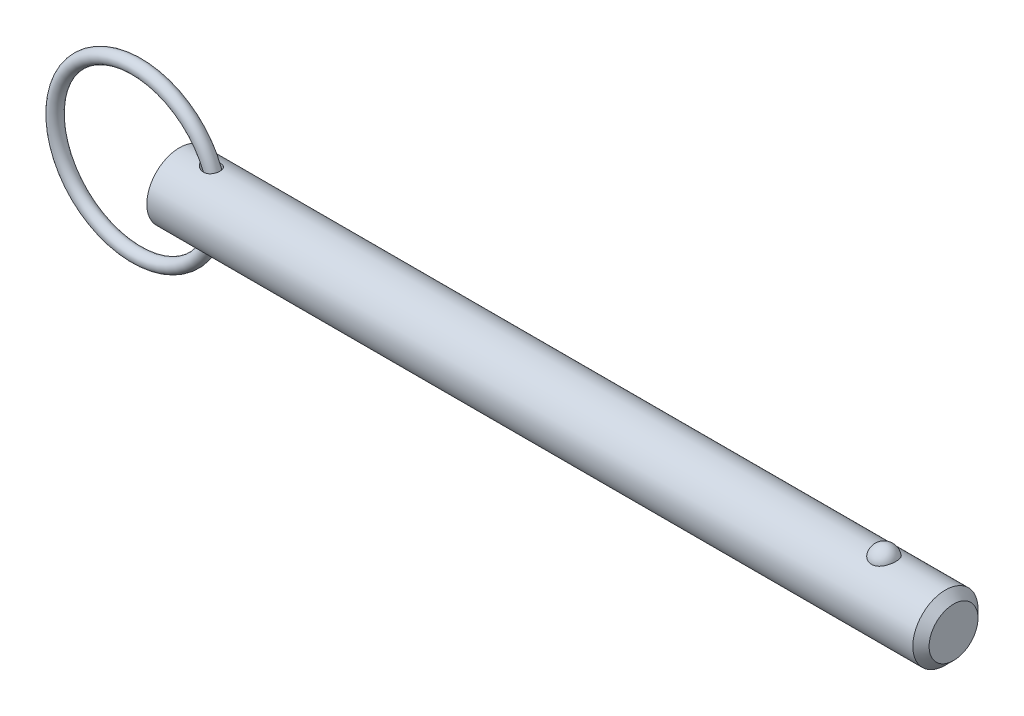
ISO-10303-21;
HEADER;
FILE_DESCRIPTION(('STEP AP214'),'2;1');
FILE_NAME('part.step','',(''),(''),'','','');
FILE_SCHEMA(('AUTOMOTIVE_DESIGN { 1 0 10303 214 1 1 1 1 }'));
ENDSEC;
DATA;
#1=APPLICATION_CONTEXT('core data for automotive mechanical design processes');
#2=APPLICATION_PROTOCOL_DEFINITION('international standard','automotive_design',2000,#1);
#3=PRODUCT_CONTEXT('',#1,'mechanical');
#4=PRODUCT('Part','Part','',(#3));
#5=PRODUCT_RELATED_PRODUCT_CATEGORY('part','',(#4));
#6=PRODUCT_DEFINITION_FORMATION('','',#4);
#7=PRODUCT_DEFINITION_CONTEXT('part definition',#1,'design');
#8=PRODUCT_DEFINITION('design','',#6,#7);
#9=PRODUCT_DEFINITION_SHAPE('','',#8);
#10=(LENGTH_UNIT() NAMED_UNIT(*) SI_UNIT(.MILLI.,.METRE.));
#11=(NAMED_UNIT(*) PLANE_ANGLE_UNIT() SI_UNIT($,.RADIAN.));
#12=(NAMED_UNIT(*) SI_UNIT($,.STERADIAN.) SOLID_ANGLE_UNIT());
#13=UNCERTAINTY_MEASURE_WITH_UNIT(LENGTH_MEASURE(1.E-05),#10,'distance_accuracy_value','');
#14=(GEOMETRIC_REPRESENTATION_CONTEXT(3) GLOBAL_UNCERTAINTY_ASSIGNED_CONTEXT((#13)) GLOBAL_UNIT_ASSIGNED_CONTEXT((#10,
#11,#12)) REPRESENTATION_CONTEXT('',''));
#15=CARTESIAN_POINT('',(0.,0.,0.));
#16=DIRECTION('',(0.,0.,1.));
#17=DIRECTION('',(1.,0.,0.));
#18=AXIS2_PLACEMENT_3D('',#15,#16,#17);
#19=CARTESIAN_POINT('',(-8.34703434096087,0.,0.));
#20=DIRECTION('',(0.,0.,1.));
#21=DIRECTION('',(1.,0.,0.));
#22=AXIS2_PLACEMENT_3D('',#19,#20,#21);
#23=TOROIDAL_SURFACE('',#22,15.875,1.27);
#24=CARTESIAN_POINT('',(8.79796565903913,0.,0.));
#25=VERTEX_POINT('',#24);
#26=VERTEX_LOOP('',#25);
#27=FACE_BOUND('',#26,.T.);
#28=ADVANCED_FACE('P0_F12',(#27),#23,.T.);
#29=CLOSED_SHELL('',(#28));
#30=MANIFOLD_SOLID_BREP('P0_B1',#29);
#31=CARTESIAN_POINT('',(0.,0.,0.));
#32=DIRECTION('',(1.,0.,0.));
#33=DIRECTION('',(0.,0.,-1.));
#34=AXIS2_PLACEMENT_3D('',#31,#32,#33);
#35=CYLINDRICAL_SURFACE('',#34,6.35);
#36=CARTESIAN_POINT('',(4.87230670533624,6.27273159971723,-0.987592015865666));
#37=CARTESIAN_POINT('',(4.94734735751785,6.26035058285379,-1.06623378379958));
#38=CARTESIAN_POINT('',(5.02968768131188,6.24755813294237,-1.13788608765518));
#39=CARTESIAN_POINT('',(5.20534267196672,6.22278258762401,-1.26640223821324));
#40=CARTESIAN_POINT('',(5.29867273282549,6.21080066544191,-1.32324497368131));
#41=CARTESIAN_POINT('',(5.49318962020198,6.18912414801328,-1.42117930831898));
#42=CARTESIAN_POINT('',(5.59435470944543,6.17942350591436,-1.46231273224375));
#43=CARTESIAN_POINT('',(5.80219659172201,6.16352555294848,-1.52793951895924));
#44=CARTESIAN_POINT('',(5.90887152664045,6.15732706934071,-1.55243845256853));
#45=CARTESIAN_POINT('',(6.12818220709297,6.14931784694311,-1.58387975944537));
#46=CARTESIAN_POINT('',(6.24090110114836,6.14763959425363,-1.59029227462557));
#47=CARTESIAN_POINT('',(6.46560233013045,6.14965588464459,-1.58248630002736));
#48=CARTESIAN_POINT('',(6.57758514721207,6.15334646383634,-1.56828303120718));
#49=CARTESIAN_POINT('',(6.78516594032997,6.1652116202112,-1.52091398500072));
#50=CARTESIAN_POINT('',(6.88126802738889,6.17288876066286,-1.48983713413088));
#51=CARTESIAN_POINT('',(7.06576629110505,6.19149190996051,-1.41052329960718));
#52=CARTESIAN_POINT('',(7.15416739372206,6.20241582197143,-1.36229738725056));
#53=CARTESIAN_POINT('',(7.3116692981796,6.2248616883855,-1.25548983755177));
#54=CARTESIAN_POINT('',(7.38181442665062,6.23621734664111,-1.19840625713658));
#55=CARTESIAN_POINT('',(7.51101296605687,6.259037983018,-1.07284763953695));
#56=CARTESIAN_POINT('',(7.5700684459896,6.2705029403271,-1.00437473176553));
#57=CARTESIAN_POINT('',(7.67374693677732,6.29184873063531,-0.860384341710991));
#58=CARTESIAN_POINT('',(7.71876694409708,6.30176816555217,-0.785157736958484));
#59=CARTESIAN_POINT('',(7.79574491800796,6.31935829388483,-0.628053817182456));
#60=CARTESIAN_POINT('',(7.82770308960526,6.32702902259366,-0.546176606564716));
#61=CARTESIAN_POINT('',(7.87788845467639,6.33930929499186,-0.377876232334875));
#62=CARTESIAN_POINT('',(7.8960810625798,6.34391112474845,-0.291442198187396));
#63=CARTESIAN_POINT('',(7.91820729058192,6.34953044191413,-0.116652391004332));
#64=CARTESIAN_POINT('',(7.92214044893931,6.35054781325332,-0.0282965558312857));
#65=CARTESIAN_POINT('',(7.91564686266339,6.34888556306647,0.14826357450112));
#66=CARTESIAN_POINT('',(7.9051533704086,6.34618875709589,0.236465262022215));
#67=CARTESIAN_POINT('',(7.86991530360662,6.33735741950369,0.409798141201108));
#68=CARTESIAN_POINT('',(7.84517062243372,6.33122286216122,0.494929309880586));
#69=CARTESIAN_POINT('',(7.78199851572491,6.31618517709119,0.659657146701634));
#70=CARTESIAN_POINT('',(7.74357645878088,6.30728313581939,0.739255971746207));
#71=CARTESIAN_POINT('',(7.65396632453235,6.28769050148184,0.890663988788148));
#72=CARTESIAN_POINT('',(7.60277911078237,6.27700002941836,0.962473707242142));
#73=CARTESIAN_POINT('',(7.48925881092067,6.2550822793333,1.09590260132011));
#74=CARTESIAN_POINT('',(7.42698604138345,6.24385813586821,1.15757361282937));
#75=CARTESIAN_POINT('',(7.29283556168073,6.2220655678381,1.26951234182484));
#76=CARTESIAN_POINT('',(7.22095880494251,6.21149707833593,1.31978118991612));
#77=CARTESIAN_POINT('',(7.06971853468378,6.19216002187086,1.40772509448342));
#78=CARTESIAN_POINT('',(6.99035873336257,6.18339056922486,1.44540635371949));
#79=CARTESIAN_POINT('',(6.826427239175,6.16851603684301,1.50762653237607));
#80=CARTESIAN_POINT('',(6.74185489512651,6.16241129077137,1.53216380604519));
#81=CARTESIAN_POINT('',(6.56686412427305,6.15321474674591,1.56869994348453));
#82=CARTESIAN_POINT('',(6.47634467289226,6.15023369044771,1.58023897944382));
#83=CARTESIAN_POINT('',(6.29456956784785,6.14778331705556,1.58974172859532));
#84=CARTESIAN_POINT('',(6.20331368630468,6.1483151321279,1.58770106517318));
#85=CARTESIAN_POINT('',(6.01385969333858,6.15284811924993,1.5700487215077));
#86=CARTESIAN_POINT('',(5.91578322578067,6.15715979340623,1.55322212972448));
#87=CARTESIAN_POINT('',(5.72331909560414,6.16902415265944,1.5054032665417));
#88=CARTESIAN_POINT('',(5.62893440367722,6.17657939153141,1.4743998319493));
#89=CARTESIAN_POINT('',(5.43572606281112,6.19502494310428,1.39499475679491));
#90=CARTESIAN_POINT('',(5.33755891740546,6.20619097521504,1.3450526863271));
#91=CARTESIAN_POINT('',(5.15090047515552,6.23006191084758,1.22975103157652));
#92=CARTESIAN_POINT('',(5.06240741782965,6.24276653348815,1.16439425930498));
#93=CARTESIAN_POINT('',(4.91171642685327,6.26607433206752,1.03083814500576));
#94=CARTESIAN_POINT('',(4.84758224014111,6.27668356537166,0.964825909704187));
#95=CARTESIAN_POINT('',(4.73090054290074,6.29683133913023,0.823112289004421));
#96=CARTESIAN_POINT('',(4.6783368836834,6.30637136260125,0.747424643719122));
#97=CARTESIAN_POINT('',(4.59543145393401,6.32183254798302,0.601150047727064));
#98=CARTESIAN_POINT('',(4.56283099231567,6.32809321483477,0.531883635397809));
#99=CARTESIAN_POINT('',(4.50941370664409,6.33849198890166,0.388778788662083));
#100=CARTESIAN_POINT('',(4.48858876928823,6.34263155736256,0.314943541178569));
#101=CARTESIAN_POINT('',(4.46008864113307,6.3483236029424,0.164282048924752));
#102=CARTESIAN_POINT('',(4.45247558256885,6.34986385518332,0.0874434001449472));
#103=CARTESIAN_POINT('',(4.45121096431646,6.35011863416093,-0.0663538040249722));
#104=CARTESIAN_POINT('',(4.45755802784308,6.34883343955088,-0.143312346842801));
#105=CARTESIAN_POINT('',(4.48267656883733,6.34380948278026,-0.288945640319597));
#106=CARTESIAN_POINT('',(4.50045680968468,6.34026665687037,-0.357802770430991));
#107=CARTESIAN_POINT('',(4.54636050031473,6.33128211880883,-0.49181574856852));
#108=CARTESIAN_POINT('',(4.57448566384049,6.32584009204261,-0.556970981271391));
#109=CARTESIAN_POINT('',(4.64209700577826,6.31308107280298,-0.687092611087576));
#110=CARTESIAN_POINT('',(4.68226903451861,6.30565525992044,-0.75168940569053));
#111=CARTESIAN_POINT('',(4.77120834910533,6.28979741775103,-0.874524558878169));
#112=CARTESIAN_POINT('',(4.81998302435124,6.28136452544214,-0.932757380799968));
#113=CARTESIAN_POINT('',(4.87230670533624,6.27273159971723,-0.987592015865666));
#114=B_SPLINE_CURVE_WITH_KNOTS('',3,(#36,#37,#38,#39,#40,#41,#42,#43,#44,#45,#46,#47,#48,#49,
#50,#51,#52,#53,#54,#55,#56,#57,#58,#59,#60,#61,#62,#63,#64,#65,#66,#67,#68,#69,#70,#71,#72,#73,
#74,#75,#76,#77,#78,#79,#80,#81,#82,#83,#84,#85,#86,#87,#88,#89,#90,#91,#92,#93,#94,#95,#96,#97,
#98,#99,#100,#101,#102,#103,#104,#105,#106,#107,#108,#109,#110,#111,#112,#113),.UNSPECIFIED.,
.T.,.F.,(4,2,2,2,2,2,2,2,2,2,2,2,2,2,2,2,2,2,2,2,2,2,2,2,2,2,2,2,2,2,2,2,2,2,2,2,2,2,4),(0.,
0.327902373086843,0.65626964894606,0.98375647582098,1.31113357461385,1.64800657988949,
1.98463099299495,2.28681225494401,2.58879878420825,2.86088594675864,3.13292229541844,
3.39636481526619,3.65980320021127,3.92390128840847,4.18800792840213,4.45334062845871,
4.7186753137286,4.98390596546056,5.24911867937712,5.51293017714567,5.7767155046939,
6.04037065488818,6.30405880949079,6.57680801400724,6.84964512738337,7.14724526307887,
7.44508014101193,7.77572668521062,8.10631295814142,8.38318772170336,8.65967357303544,
8.8891530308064,9.11847418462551,9.34887088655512,9.57924486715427,9.79193291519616,
10.0046562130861,10.2330958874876,10.4617327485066),.UNSPECIFIED.);
#115=CARTESIAN_POINT('',(4.87230670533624,6.27273159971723,-0.987592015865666));
#116=VERTEX_POINT('',#115);
#117=EDGE_CURVE('P1_E40',#116,#116,#114,.T.);
#118=ORIENTED_EDGE('',*,*,#117,.T.);
#119=EDGE_LOOP('',(#118));
#120=FACE_BOUND('',#119,.T.);
#121=CARTESIAN_POINT('',(149.2125,0.,0.));
#122=DIRECTION('',(1.,0.,0.));
#123=DIRECTION('',(0.,0.,-1.));
#124=AXIS2_PLACEMENT_3D('',#121,#122,#123);
#125=CIRCLE('',#124,6.35);
#126=CARTESIAN_POINT('',(149.2125,0.,-6.35));
#127=VERTEX_POINT('',#126);
#128=EDGE_CURVE('P1_E25',#127,#127,#125,.T.);
#129=ORIENTED_EDGE('',*,*,#128,.F.);
#130=EDGE_LOOP('',(#129));
#131=FACE_BOUND('',#130,.T.);
#132=CARTESIAN_POINT('',(0.,0.,0.));
#133=DIRECTION('',(1.,0.,0.));
#134=DIRECTION('',(0.,0.,-1.));
#135=AXIS2_PLACEMENT_3D('',#132,#133,#134);
#136=CIRCLE('',#135,6.35);
#137=CARTESIAN_POINT('',(0.,0.,-6.35));
#138=VERTEX_POINT('',#137);
#139=EDGE_CURVE('P1_E9',#138,#138,#136,.T.);
#140=ORIENTED_EDGE('',*,*,#139,.T.);
#141=EDGE_LOOP('',(#140));
#142=FACE_BOUND('',#141,.T.);
#143=CARTESIAN_POINT('',(137.250021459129,5.87502187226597,2.40969251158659));
#144=CARTESIAN_POINT('',(137.125030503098,5.87501645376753,2.40969773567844));
#145=CARTESIAN_POINT('',(137.000080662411,5.87916061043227,2.39967292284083));
#146=CARTESIAN_POINT('',(136.753909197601,5.8952311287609,2.35991730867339));
#147=CARTESIAN_POINT('',(136.632686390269,5.90715499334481,2.33019283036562));
#148=CARTESIAN_POINT('',(136.397517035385,5.93739567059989,2.25201402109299));
#149=CARTESIAN_POINT('',(136.283560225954,5.95570321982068,2.20358681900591));
#150=CARTESIAN_POINT('',(136.06557352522,5.99672067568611,2.08937987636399));
#151=CARTESIAN_POINT('',(135.961545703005,6.01943149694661,2.02359652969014));
#152=CARTESIAN_POINT('',(135.762943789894,6.06760647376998,1.87428969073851));
#153=CARTESIAN_POINT('',(135.668726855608,6.09313095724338,1.79031110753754));
#154=CARTESIAN_POINT('',(135.495255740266,6.14375873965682,1.60800178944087));
#155=CARTESIAN_POINT('',(135.416004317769,6.16886196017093,1.50966841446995));
#156=CARTESIAN_POINT('',(135.270845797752,6.21724600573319,1.29645884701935));
#157=CARTESIAN_POINT('',(135.205688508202,6.24039621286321,1.18104158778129));
#158=CARTESIAN_POINT('',(135.094703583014,6.28117277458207,0.940351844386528));
#159=CARTESIAN_POINT('',(135.048877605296,6.29879865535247,0.815078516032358));
#160=CARTESIAN_POINT('',(134.977023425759,6.32692073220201,0.55649439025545));
#161=CARTESIAN_POINT('',(134.951249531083,6.33732517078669,0.42310277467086));
#162=CARTESIAN_POINT('',(134.920988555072,6.34957673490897,0.153542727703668));
#163=CARTESIAN_POINT('',(134.916500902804,6.35142408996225,0.0173743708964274));
#164=CARTESIAN_POINT('',(134.928865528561,6.34638925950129,-0.253036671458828));
#165=CARTESIAN_POINT('',(134.945594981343,6.33955731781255,-0.387285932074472));
#166=CARTESIAN_POINT('',(134.999843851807,6.31794129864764,-0.650851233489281));
#167=CARTESIAN_POINT('',(135.037363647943,6.30315707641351,-0.7801671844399));
#168=CARTESIAN_POINT('',(135.132500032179,6.26711642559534,-1.03041949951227));
#169=CARTESIAN_POINT('',(135.190143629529,6.24585130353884,-1.1513443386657));
#170=CARTESIAN_POINT('',(135.324352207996,6.19905619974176,-1.38129800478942));
#171=CARTESIAN_POINT('',(135.400918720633,6.17352587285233,-1.49032586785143));
#172=CARTESIAN_POINT('',(135.571753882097,6.12080227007,-1.69393164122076));
#173=CARTESIAN_POINT('',(135.666100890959,6.09360200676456,-1.78844209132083));
#174=CARTESIAN_POINT('',(135.870119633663,6.04070434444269,-1.95970536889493));
#175=CARTESIAN_POINT('',(135.979790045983,6.01500681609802,-2.03645972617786));
#176=CARTESIAN_POINT('',(136.209187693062,5.96867714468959,-2.1684564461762));
#177=CARTESIAN_POINT('',(136.328652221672,5.94794910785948,-2.2241206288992));
#178=CARTESIAN_POINT('',(136.576218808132,5.91340580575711,-2.31440992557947));
#179=CARTESIAN_POINT('',(136.704317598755,5.8995879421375,-2.3490429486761));
#180=CARTESIAN_POINT('',(136.958582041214,5.88111049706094,-2.39491590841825));
#181=CARTESIAN_POINT('',(137.084520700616,5.876025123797,-2.40724512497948));
#182=CARTESIAN_POINT('',(137.336786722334,5.87428980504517,-2.41147867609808));
#183=CARTESIAN_POINT('',(137.463114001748,5.87763817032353,-2.40338710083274));
#184=CARTESIAN_POINT('',(137.708417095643,5.89212921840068,-2.36762715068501));
#185=CARTESIAN_POINT('',(137.827499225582,5.90302431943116,-2.34058030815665));
#186=CARTESIAN_POINT('',(138.05924472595,5.93113752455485,-2.26839066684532));
#187=CARTESIAN_POINT('',(138.171907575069,5.94835614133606,-2.22324640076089));
#188=CARTESIAN_POINT('',(138.390400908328,5.98773016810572,-2.11493806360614));
#189=CARTESIAN_POINT('',(138.496028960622,6.00998499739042,-2.05140269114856));
#190=CARTESIAN_POINT('',(138.695300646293,6.05690144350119,-1.90842705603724));
#191=CARTESIAN_POINT('',(138.788941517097,6.08156361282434,-1.82898313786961));
#192=CARTESIAN_POINT('',(138.966675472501,6.13211715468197,-1.65182429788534));
#193=CARTESIAN_POINT('',(139.050055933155,6.15800825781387,-1.55339381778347));
#194=CARTESIAN_POINT('',(139.199790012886,6.20712834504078,-1.34374214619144));
#195=CARTESIAN_POINT('',(139.266140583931,6.23035685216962,-1.23251867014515));
#196=CARTESIAN_POINT('',(139.382345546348,6.27251177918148,-0.996447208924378));
#197=CARTESIAN_POINT('',(139.431607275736,6.29127762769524,-0.871278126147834));
#198=CARTESIAN_POINT('',(139.509614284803,6.3215862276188,-0.613870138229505));
#199=CARTESIAN_POINT('',(139.538359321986,6.33312889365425,-0.481631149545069));
#200=CARTESIAN_POINT('',(139.57477058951,6.34782349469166,-0.213672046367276));
#201=CARTESIAN_POINT('',(139.582413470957,6.35096613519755,-0.0779482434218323));
#202=CARTESIAN_POINT('',(139.576395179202,6.34851322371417,0.192943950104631));
#203=CARTESIAN_POINT('',(139.562734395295,6.3429178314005,0.328112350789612));
#204=CARTESIAN_POINT('',(139.51450361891,6.32360512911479,0.593406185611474));
#205=CARTESIAN_POINT('',(139.480031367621,6.30992579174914,0.723552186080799));
#206=CARTESIAN_POINT('',(139.390953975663,6.27586325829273,0.975834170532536));
#207=CARTESIAN_POINT('',(139.33634761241,6.25547965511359,1.09796966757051));
#208=CARTESIAN_POINT('',(139.20775879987,6.20998183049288,1.33148921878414));
#209=CARTESIAN_POINT('',(139.133674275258,6.18484288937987,1.44281227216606));
#210=CARTESIAN_POINT('',(138.967820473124,6.13258735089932,1.65087683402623));
#211=CARTESIAN_POINT('',(138.876051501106,6.10547078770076,1.74761859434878));
#212=CARTESIAN_POINT('',(138.677183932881,6.0523587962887,1.92350926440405));
#213=CARTESIAN_POINT('',(138.570133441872,6.0263601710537,2.00271146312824));
#214=CARTESIAN_POINT('',(138.343138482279,5.97843747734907,2.1415415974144));
#215=CARTESIAN_POINT('',(138.223191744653,5.95651412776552,2.20116608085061));
#216=CARTESIAN_POINT('',(137.964523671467,5.91812106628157,2.30250570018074));
#217=CARTESIAN_POINT('',(137.82506980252,5.90217533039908,2.34256795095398));
#218=CARTESIAN_POINT('',(137.540397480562,5.88063128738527,2.39615214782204));
#219=CARTESIAN_POINT('',(137.39518174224,5.8750281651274,2.40968644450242));
#220=CARTESIAN_POINT('',(137.250021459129,5.87502187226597,2.40969251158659));
#221=B_SPLINE_CURVE_WITH_KNOTS('',3,(#143,#144,#145,#146,#147,#148,#149,#150,#151,#152,#153,
#154,#155,#156,#157,#158,#159,#160,#161,#162,#163,#164,#165,#166,#167,#168,#169,#170,#171,#172,
#173,#174,#175,#176,#177,#178,#179,#180,#181,#182,#183,#184,#185,#186,#187,#188,#189,#190,#191,
#192,#193,#194,#195,#196,#197,#198,#199,#200,#201,#202,#203,#204,#205,#206,#207,#208,#209,#210,
#211,#212,#213,#214,#215,#216,#217,#218,#219,#220),.UNSPECIFIED.,.T.,.F.,(4,2,2,2,2,2,2,2,2,2,2,
2,2,2,2,2,2,2,2,2,2,2,2,2,2,2,2,2,2,2,2,2,2,2,2,2,2,2,4),(0.,0.374440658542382,
0.748761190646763,1.12254078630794,1.49639810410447,1.88098871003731,2.2656501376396,
2.6674110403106,3.06920639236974,3.47601794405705,3.88281858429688,4.28727498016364,
4.69173873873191,5.09674745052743,5.50178895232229,5.9086591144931,6.31549420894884,
6.71369855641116,7.11175305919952,7.48978077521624,7.86773278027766,8.2338388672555,
8.59997464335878,8.97409044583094,9.34829231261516,9.74122667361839,10.1342313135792,
10.5397522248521,10.9452779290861,11.3512521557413,11.7572189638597,12.1612938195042,
12.5653932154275,12.9716540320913,13.3779078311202,13.7829098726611,14.1879832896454,
14.6230486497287,15.0579114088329),.UNSPECIFIED.);
#222=CARTESIAN_POINT('',(137.250021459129,5.87502187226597,2.40969251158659));
#223=VERTEX_POINT('',#222);
#224=EDGE_CURVE('P1_E34',#223,#223,#221,.T.);
#225=ORIENTED_EDGE('',*,*,#224,.T.);
#226=EDGE_LOOP('',(#225));
#227=FACE_BOUND('',#226,.T.);
#228=CARTESIAN_POINT('',(4.87230670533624,-6.27273159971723,-0.987592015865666));
#229=CARTESIAN_POINT('',(4.81440819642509,-6.28228431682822,-0.926913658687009));
#230=CARTESIAN_POINT('',(4.76085022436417,-6.29159289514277,-0.862071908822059));
#231=CARTESIAN_POINT('',(4.66448472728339,-6.3088950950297,-0.724655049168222));
#232=CARTESIAN_POINT('',(4.62166818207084,-6.31688981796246,-0.652086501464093));
#233=CARTESIAN_POINT('',(4.54882773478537,-6.33076917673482,-0.499747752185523));
#234=CARTESIAN_POINT('',(4.51891553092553,-6.33663532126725,-0.419921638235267));
#235=CARTESIAN_POINT('',(4.4747692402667,-6.3453711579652,-0.255882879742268));
#236=CARTESIAN_POINT('',(4.4605188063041,-6.34824397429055,-0.171674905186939));
#237=CARTESIAN_POINT('',(4.44966179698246,-6.35043041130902,-0.012076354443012));
#238=CARTESIAN_POINT('',(4.45117530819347,-6.35012328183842,0.063184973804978));
#239=CARTESIAN_POINT('',(4.46726452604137,-6.34689000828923,0.212230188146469));
#240=CARTESIAN_POINT('',(4.48184026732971,-6.3439638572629,0.286014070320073));
#241=CARTESIAN_POINT('',(4.52202068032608,-6.33603071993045,0.426550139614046));
#242=CARTESIAN_POINT('',(4.54707079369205,-6.33112875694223,0.493469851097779));
#243=CARTESIAN_POINT('',(4.60669855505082,-6.31972370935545,0.622743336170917));
#244=CARTESIAN_POINT('',(4.64127887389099,-6.31322017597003,0.685095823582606));
#245=CARTESIAN_POINT('',(4.7232814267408,-6.29826068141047,0.811769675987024));
#246=CARTESIAN_POINT('',(4.77176118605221,-6.28966287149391,0.87538636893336));
#247=CARTESIAN_POINT('',(4.87703902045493,-6.27182325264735,0.995192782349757));
#248=CARTESIAN_POINT('',(4.93384225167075,-6.26258104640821,1.05137785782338));
#249=CARTESIAN_POINT('',(5.06617436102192,-6.24228878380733,1.16635591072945));
#250=CARTESIAN_POINT('',(5.14318167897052,-6.23124423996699,1.22345054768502));
#251=CARTESIAN_POINT('',(5.3047576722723,-6.21023402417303,1.32598441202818));
#252=CARTESIAN_POINT('',(5.38933237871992,-6.20026922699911,1.37141422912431));
#253=CARTESIAN_POINT('',(5.57760134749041,-6.18099350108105,1.45601817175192));
#254=CARTESIAN_POINT('',(5.68224348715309,-6.17201456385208,1.4931788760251));
#255=CARTESIAN_POINT('',(5.89649087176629,-6.15800474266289,1.5499484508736));
#256=CARTESIAN_POINT('',(6.00609708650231,-6.15297463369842,1.56955387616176));
#257=CARTESIAN_POINT('',(6.22752772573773,-6.14779725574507,1.58971993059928));
#258=CARTESIAN_POINT('',(6.33935715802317,-6.14766266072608,1.59023112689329));
#259=CARTESIAN_POINT('',(6.56108231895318,-6.15269227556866,1.57066564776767));
#260=CARTESIAN_POINT('',(6.67097982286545,-6.15785133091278,1.55060899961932));
#261=CARTESIAN_POINT('',(6.87257705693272,-6.17211580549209,1.4927326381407));
#262=CARTESIAN_POINT('',(6.96494608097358,-6.18072242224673,1.45711948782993));
#263=CARTESIAN_POINT('',(7.14129343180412,-6.20069920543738,1.36960980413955));
#264=CARTESIAN_POINT('',(7.22527609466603,-6.21206793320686,1.31772174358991));
#265=CARTESIAN_POINT('',(7.37471505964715,-6.23497047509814,1.20443359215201));
#266=CARTESIAN_POINT('',(7.44115811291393,-6.24639757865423,1.14430788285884));
#267=CARTESIAN_POINT('',(7.56261868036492,-6.26896339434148,1.0134084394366));
#268=CARTESIAN_POINT('',(7.61763801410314,-6.28010215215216,0.942636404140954));
#269=CARTESIAN_POINT('',(7.71360563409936,-6.30055923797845,0.794304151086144));
#270=CARTESIAN_POINT('',(7.75485562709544,-6.3099143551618,0.716943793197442));
#271=CARTESIAN_POINT('',(7.82406051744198,-6.32610528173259,0.556244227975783));
#272=CARTESIAN_POINT('',(7.85201540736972,-6.33294108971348,0.472905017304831));
#273=CARTESIAN_POINT('',(7.89408663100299,-6.34338077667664,0.302249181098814));
#274=CARTESIAN_POINT('',(7.90814615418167,-6.34697138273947,0.214917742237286));
#275=CARTESIAN_POINT('',(7.92192329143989,-6.35048887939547,0.0390564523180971));
#276=CARTESIAN_POINT('',(7.92164046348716,-6.3504156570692,-0.0494734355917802));
#277=CARTESIAN_POINT('',(7.9067075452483,-6.34660520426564,-0.225592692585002));
#278=CARTESIAN_POINT('',(7.89199989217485,-6.34285329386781,-0.313176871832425));
#279=CARTESIAN_POINT('',(7.84845340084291,-6.33206809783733,-0.484549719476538));
#280=CARTESIAN_POINT('',(7.8196145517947,-6.32503480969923,-0.568338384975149));
#281=CARTESIAN_POINT('',(7.74850591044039,-6.30846389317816,-0.729625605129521));
#282=CARTESIAN_POINT('',(7.70625193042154,-6.29892921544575,-0.807131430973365));
#283=CARTESIAN_POINT('',(7.60933437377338,-6.27840608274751,-0.953731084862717));
#284=CARTESIAN_POINT('',(7.55467181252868,-6.2674177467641,-1.02282560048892));
#285=CARTESIAN_POINT('',(7.43471786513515,-6.24527869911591,-1.15028913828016));
#286=CARTESIAN_POINT('',(7.36948829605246,-6.23412925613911,-1.20871657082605));
#287=CARTESIAN_POINT('',(7.23001723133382,-6.21283678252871,-1.3137894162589));
#288=CARTESIAN_POINT('',(7.15577649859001,-6.20269366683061,-1.36043582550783));
#289=CARTESIAN_POINT('',(7.00025986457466,-6.18446636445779,-1.44103993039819));
#290=CARTESIAN_POINT('',(6.91896776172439,-6.17638709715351,-1.47496739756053));
#291=CARTESIAN_POINT('',(6.75184232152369,-6.16309237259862,-1.52957024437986));
#292=CARTESIAN_POINT('',(6.6660081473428,-6.15787744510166,-1.55024317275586));
#293=CARTESIAN_POINT('',(6.48842585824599,-6.15055064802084,-1.57906962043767));
#294=CARTESIAN_POINT('',(6.39658108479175,-6.14857915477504,-1.58665744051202));
#295=CARTESIAN_POINT('',(6.21279832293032,-6.14817707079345,-1.58821048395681));
#296=CARTESIAN_POINT('',(6.12086031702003,-6.14974736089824,-1.58217231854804));
#297=CARTESIAN_POINT('',(5.92996902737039,-6.15640095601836,-1.55609403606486));
#298=CARTESIAN_POINT('',(5.83120653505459,-6.16181208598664,-1.53474519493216));
#299=CARTESIAN_POINT('',(5.63804881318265,-6.17573474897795,-1.47771859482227));
#300=CARTESIAN_POINT('',(5.54365953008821,-6.18425037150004,-1.44202192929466));
#301=CARTESIAN_POINT('',(5.34413923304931,-6.20522938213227,-1.34918979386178));
#302=CARTESIAN_POINT('',(5.24033140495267,-6.21813417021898,-1.28928337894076));
#303=CARTESIAN_POINT('',(5.0455423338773,-6.24510162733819,-1.15156760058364));
#304=CARTESIAN_POINT('',(4.95454590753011,-6.25916289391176,-1.07377972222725));
#305=CARTESIAN_POINT('',(4.87230670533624,-6.27273159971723,-0.987592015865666));
#306=B_SPLINE_CURVE_WITH_KNOTS('',3,(#228,#229,#230,#231,#232,#233,#234,#235,#236,#237,#238,
#239,#240,#241,#242,#243,#244,#245,#246,#247,#248,#249,#250,#251,#252,#253,#254,#255,#256,#257,
#258,#259,#260,#261,#262,#263,#264,#265,#266,#267,#268,#269,#270,#271,#272,#273,#274,#275,#276,
#277,#278,#279,#280,#281,#282,#283,#284,#285,#286,#287,#288,#289,#290,#291,#292,#293,#294,#295,
#296,#297,#298,#299,#300,#301,#302,#303,#304,#305),.UNSPECIFIED.,.T.,.F.,(4,2,2,2,2,2,2,2,2,2,2,
2,2,2,2,2,2,2,2,2,2,2,2,2,2,2,2,2,2,2,2,2,2,2,2,2,2,2,4),(0.,0.252951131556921,0.50568912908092,
0.760572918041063,1.01519041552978,1.23982791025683,1.46446600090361,1.67847364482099,
1.89254132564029,2.13299551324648,2.37359928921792,2.6619896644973,2.95061196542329,
3.28329078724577,3.61603488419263,3.94964035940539,4.282921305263,4.57939201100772,
4.87570862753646,5.14538810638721,5.4150245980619,5.67829123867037,5.94155802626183,
6.20589676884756,6.47024365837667,6.73564974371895,7.00105603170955,7.26615064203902,
7.53122356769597,7.79479837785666,8.05835088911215,8.32252586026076,8.58674967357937,
8.86213419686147,9.137587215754,9.43991696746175,9.74264642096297,10.1023688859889,
10.461661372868),.UNSPECIFIED.);
#307=CARTESIAN_POINT('',(4.87230670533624,-6.27273159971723,-0.987592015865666));
#308=VERTEX_POINT('',#307);
#309=EDGE_CURVE('P1_E17',#308,#308,#306,.T.);
#310=ORIENTED_EDGE('',*,*,#309,.T.);
#311=EDGE_LOOP('',(#310));
#312=FACE_BOUND('',#311,.T.);
#313=ADVANCED_FACE('P1_F13',(#120,#131,#142,#227,#312),#35,.T.);
#314=CARTESIAN_POINT('',(0.,0.,0.));
#315=DIRECTION('',(-1.,0.,0.));
#316=DIRECTION('',(0.,0.,1.));
#317=AXIS2_PLACEMENT_3D('',#314,#315,#316);
#318=PLANE('',#317);
#319=ORIENTED_EDGE('',*,*,#139,.F.);
#320=EDGE_LOOP('',(#319));
#321=FACE_BOUND('',#320,.T.);
#322=ADVANCED_FACE('P1_F15',(#321),#318,.T.);
#323=CARTESIAN_POINT('',(150.8,0.,0.));
#324=DIRECTION('',(-1.,0.,0.));
#325=DIRECTION('',(0.,0.,1.));
#326=AXIS2_PLACEMENT_3D('',#323,#324,#325);
#327=CONICAL_SURFACE('',#326,4.76250000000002,0.785398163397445);
#328=ORIENTED_EDGE('',*,*,#128,.T.);
#329=EDGE_LOOP('',(#328));
#330=FACE_BOUND('',#329,.T.);
#331=CARTESIAN_POINT('',(150.8,0.,0.));
#332=DIRECTION('',(1.,0.,0.));
#333=DIRECTION('',(0.,0.,-1.));
#334=AXIS2_PLACEMENT_3D('',#331,#332,#333);
#335=CIRCLE('',#334,4.76250000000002);
#336=CARTESIAN_POINT('',(150.8,0.,-4.76250000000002));
#337=VERTEX_POINT('',#336);
#338=EDGE_CURVE('P1_E30',#337,#337,#335,.T.);
#339=ORIENTED_EDGE('',*,*,#338,.F.);
#340=EDGE_LOOP('',(#339));
#341=FACE_BOUND('',#340,.T.);
#342=ADVANCED_FACE('P1_F55',(#330,#341),#327,.T.);
#343=CARTESIAN_POINT('',(150.8,4.76250000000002,0.));
#344=DIRECTION('',(1.,0.,0.));
#345=DIRECTION('',(0.,0.,-1.));
#346=AXIS2_PLACEMENT_3D('',#343,#344,#345);
#347=PLANE('',#346);
#348=ORIENTED_EDGE('',*,*,#338,.T.);
#349=EDGE_LOOP('',(#348));
#350=FACE_BOUND('',#349,.T.);
#351=ADVANCED_FACE('P1_F51',(#350),#347,.T.);
#352=CARTESIAN_POINT('',(137.250021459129,5.715,0.));
#353=DIRECTION('',(-1.,0.,0.));
#354=DIRECTION('',(0.,1.,0.));
#355=AXIS2_PLACEMENT_3D('',#352,#353,#354);
#356=SPHERICAL_SURFACE('',#355,2.415);
#357=ORIENTED_EDGE('',*,*,#224,.F.);
#358=EDGE_LOOP('',(#357));
#359=FACE_BOUND('',#358,.T.);
#360=ADVANCED_FACE('P1_F46',(#359),#356,.T.);
#361=CARTESIAN_POINT('',(-8.34703434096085,0.,0.));
#362=DIRECTION('',(0.,0.,1.));
#363=DIRECTION('',(1.,0.,0.));
#364=AXIS2_PLACEMENT_3D('',#361,#362,#363);
#365=TOROIDAL_SURFACE('',#364,15.875,1.5875);
#366=ORIENTED_EDGE('',*,*,#309,.F.);
#367=EDGE_LOOP('',(#366));
#368=FACE_BOUND('',#367,.T.);
#369=ORIENTED_EDGE('',*,*,#117,.F.);
#370=EDGE_LOOP('',(#369));
#371=FACE_BOUND('',#370,.T.);
#372=ADVANCED_FACE('P1_F50',(#368,#371),#365,.F.);
#373=CLOSED_SHELL('',(#313,#322,#342,#351,#360,#372));
#374=MANIFOLD_SOLID_BREP('P1_B1',#373);
#375=ADVANCED_BREP_SHAPE_REPRESENTATION('',(#18,#30,#374),#14);
#376=SHAPE_DEFINITION_REPRESENTATION(#9,#375);
ENDSEC;
END-ISO-10303-21;
